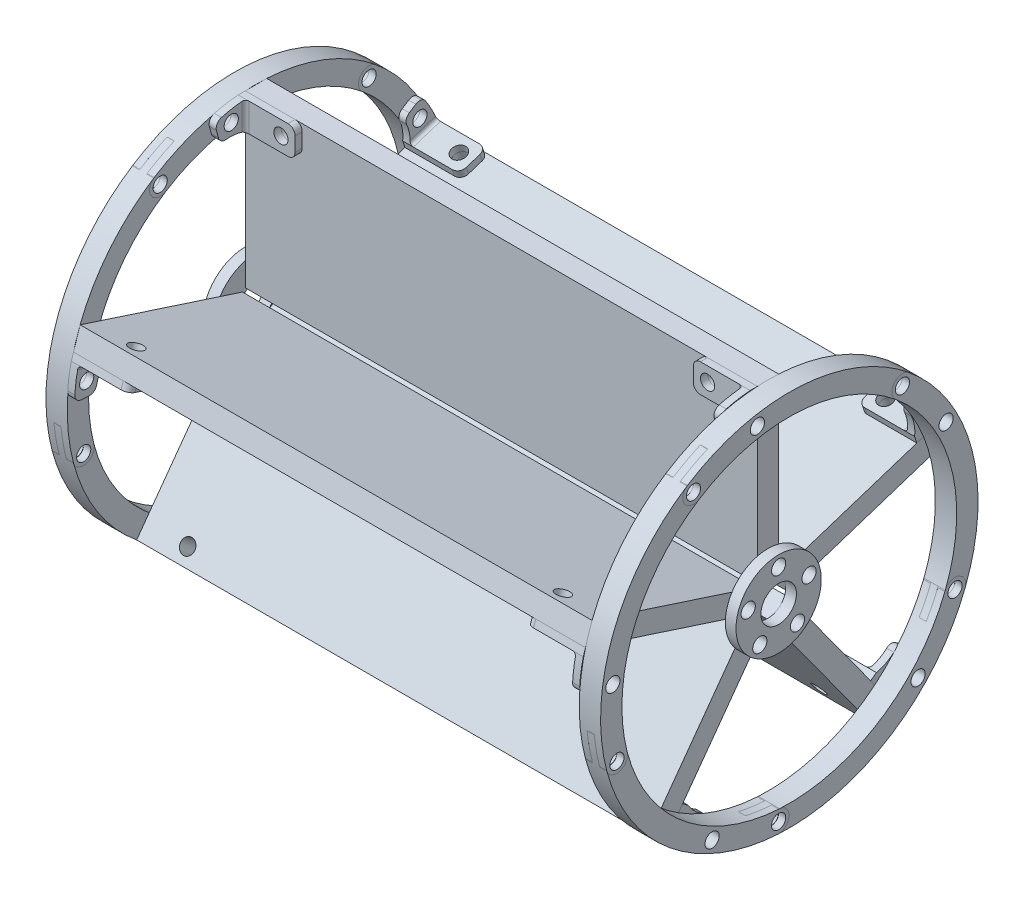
from build123d import *

# Parameters (mm, degrees)
SKETCH1_W                = 457.2
SKETCH1_H                = 152.4
SKETCH1_R                = 6.35
BOSS_EXTRUDE1_DEPTH      = 19.05
CIRPATTERN1_COUNT        = 5
SKETCH5_R                = 38.1
SKETCH5_R_2              = 15.875
BOSS_EXTRUDE2_DEPTH      = 9.525
SKETCH6_R                = 38.1
SKETCH6_R_2              = 15.875
BOSS_EXTRUDE3_DEPTH      = 9.525
CUT_EXTRUDE1_DEPTH       = 522.950438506
CUT_EXTRUDE1_DEPTH_BACK  = 522.950438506
SKETCH4_R                = 6.35
SKETCH8_R                = 6.35
BOSS_EXTRUDE4_DEPTH      = 19.05
BOSS_EXTRUDE6_DEPTH      = 3.175
BOSS_EXTRUDE6_DEPTH_BACK = 3.175
SKETCH10_R               = 6.35
CUT_EXTRUDE3_DEPTH       = 3.175
CUT_EXTRUDE3_DEPTH_BACK  = 3.175
CIRPATTERN3_COUNT        = 5
CIRPATTERN4_COUNT        = 5
SKETCH14_R               = 6.35
BOSS_EXTRUDE7_DEPTH      = 6.35
SKETCH15_R               = 6.35
BOSS_EXTRUDE8_DEPTH      = 6.35
FILLET1_R                = 6.35
FILLET3_R                = 3.175
SKETCH16_R               = 6.35
CUT_EXTRUDE5_DEPTH       = 541.863439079
CIRPATTERN6_COUNT        = 5
CIRPATTERN7_COUNT        = 5


with BuildPart() as part:
    # Sketch1 → Boss-Extrude1 (new body)
    with BuildSketch(Plane.XY):
        with Locations((228.6, 76.2)):
            Rectangle(SKETCH1_W, SKETCH1_H)
        with Locations(Location((38.1, 139.7, 0), (0, 0, 180))):
            Circle(SKETCH1_R, mode=Mode.SUBTRACT)
        with Locations(Location((419.1, 139.7, 0), (0, 0, 180))):
            Circle(SKETCH1_R, mode=Mode.SUBTRACT)
    extrude(amount=BOSS_EXTRUDE1_DEPTH)


with BuildPart() as cirpattern1_1:
    # CirPattern1: pattern copy
    add(part.part.rotate(Axis((0, -15.875, 9.525), (1, 0, 0)), 1 * 360 / CIRPATTERN1_COUNT))


with BuildPart() as cirpattern1_2:
    # CirPattern1: pattern copy
    add(part.part.rotate(Axis((0, -15.875, 9.525), (1, 0, 0)), 2 * 360 / CIRPATTERN1_COUNT))


with BuildPart() as cirpattern1_3:
    # CirPattern1: pattern copy
    add(part.part.rotate(Axis((0, -15.875, 9.525), (1, 0, 0)), 3 * 360 / CIRPATTERN1_COUNT))


with BuildPart() as cirpattern1_4:
    # CirPattern1: pattern copy
    add(part.part.rotate(Axis((0, -15.875, 9.525), (1, 0, 0)), 4 * 360 / CIRPATTERN1_COUNT))


with BuildPart() as body_6:
    # Sketch5 → Boss-Extrude2 (new body)
    with BuildSketch(Plane(origin=(457.2, 0, 0), x_dir=(0, 0, -1), z_dir=(1, 0, 0))):
        with Locations(Location((-9.525, -15.875, 0), (0, 0, 180))):
            Circle(SKETCH5_R)
        with Locations(Location((-9.525, -15.875, 0), (0, 0, 180))):
            Circle(SKETCH5_R_2, mode=Mode.SUBTRACT)
    extrude(amount=BOSS_EXTRUDE2_DEPTH)


with BuildPart() as body_7:
    # Sketch6 → Boss-Extrude3 (new body)
    with BuildSketch(Plane.ZY):
        with Locations(Location((9.525, -15.875, 0), (0, 0, 180))):
            Circle(SKETCH6_R)
        with Locations(Location((9.525, -15.875, 0), (0, 0, 180))):
            Circle(SKETCH6_R_2, mode=Mode.SUBTRACT)
    extrude(amount=BOSS_EXTRUDE3_DEPTH)


with BuildPart() as cut_extrude1_tool:
    # Sketch4 → Cut-Extrude1 (new, two sides: drawn at the far end of the back side and taken through both)
    with BuildSketch(Plane(origin=(457.2, 0, 0), x_dir=(0, 0, -1), z_dir=(1, 0, 0)).offset(-CUT_EXTRUDE1_DEPTH_BACK)):
        with Locations((-9.525, 12.7)):
            Circle(SKETCH4_R)
        with Locations((17.651439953, -7.044839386)):
            Circle(SKETCH4_R)
        with Locations((7.270963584, -38.992660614)):
            Circle(SKETCH4_R)
        with Locations((-26.320963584, -38.992660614)):
            Circle(SKETCH4_R)
        with Locations((-36.701439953, -7.044839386)):
            Circle(SKETCH4_R)
    extrude(amount=CUT_EXTRUDE1_DEPTH + CUT_EXTRUDE1_DEPTH_BACK)


with BuildPart() as part_1:
    add(part.part)

    # Cut-Extrude1: cut by cut_extrude1_tool
    add(cut_extrude1_tool.part, mode=Mode.SUBTRACT)


with BuildPart() as cirpattern1_1_1:
    add(cirpattern1_1.part)

    # Cut-Extrude1: cut by cut_extrude1_tool
    add(cut_extrude1_tool.part, mode=Mode.SUBTRACT)


with BuildPart() as cirpattern1_2_1:
    add(cirpattern1_2.part)

    # Cut-Extrude1: cut by cut_extrude1_tool
    add(cut_extrude1_tool.part, mode=Mode.SUBTRACT)


with BuildPart() as cirpattern1_3_1:
    add(cirpattern1_3.part)

    # Cut-Extrude1: cut by cut_extrude1_tool
    add(cut_extrude1_tool.part, mode=Mode.SUBTRACT)


with BuildPart() as cirpattern1_4_1:
    add(cirpattern1_4.part)

    # Cut-Extrude1: cut by cut_extrude1_tool
    add(cut_extrude1_tool.part, mode=Mode.SUBTRACT)


with BuildPart() as body_6_1:
    add(body_6.part)

    # Cut-Extrude1: cut by cut_extrude1_tool
    add(cut_extrude1_tool.part, mode=Mode.SUBTRACT)


with BuildPart() as body_7_1:
    add(body_7.part)

    # Cut-Extrude1: cut by cut_extrude1_tool
    add(cut_extrude1_tool.part, mode=Mode.SUBTRACT)


with BuildPart() as body_8:
    # Sketch8 → Boss-Extrude4 (new body)
    # profile 1 of 4: a face of its own
    with BuildSketch(Plane(origin=(457.2, 0, 0), x_dir=(0, 0, -1), z_dir=(1, 0, 0))):
        with BuildLine():
            Line((-19.05, 133.315609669), (-19.05, 152.4))
            ThreePointArc((-19.05, 152.4), (-61.608071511, 144.420211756), (-100.728676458, 125.860989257))
            ThreePointArc((-100.728676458, 125.860989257), (-102.825801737, 112.542536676), (-89.511153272, 110.421393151))
            ThreePointArc((-89.511153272, 110.421393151), (-55.721297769, 126.302585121), (-19.05, 133.315609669))
        make_face()
        with Locations(Location((-95.119914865, 118.141191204, 0), (0, 0, 180))):
            Circle(SKETCH8_R, mode=Mode.SUBTRACT)
    # profile 2 of 4: a face of its own
    with BuildSketch(Plane(origin=(457.2, 0, 0), x_dir=(0, 0, -1), z_dir=(1, 0, 0))):
        with BuildLine():
            Line((0, 133.315609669), (0, 152.4))
            Line((0, 152.4), (-19.05, 152.4))
            Line((-19.05, 152.4), (-19.05, 133.315609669))
            ThreePointArc((-19.05, 133.315609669), (-9.525, 133.619359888), (0, 133.315609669))
        make_face()
    # profile 3 of 4: a face of its own
    with BuildSketch(Plane(origin=(457.2, 0, 0), x_dir=(0, 0, -1), z_dir=(1, 0, 0))):
        with BuildLine():
            ThreePointArc((85.221128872, 99.761217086), (84.35778482, 112.80459482), (97.322712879, 114.473638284))
            ThreePointArc((97.322712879, 114.473638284), (51.673482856, 141.166226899), (0, 152.4))
            Line((0, 152.4), (0, 133.315609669))
            ThreePointArc((0, 133.315609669), (45.243525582, 123.22558319), (85.221128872, 99.761217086))
        make_face()
    # profile 4 of 4: a face of its own
    with BuildSketch(Plane(origin=(457.2, 0, 0), x_dir=(0, 0, -1), z_dir=(1, 0, 0))):
        with BuildLine():
            Line((-19.05, 152.4), (0, 152.4))
            ThreePointArc((0, 152.4), (-9.525, 152.669359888), (-19.05, 152.4))
        make_face()
    extrude(amount=BOSS_EXTRUDE4_DEPTH)

    # Sketch10 → Boss-Extrude6 (add, two sides: drawn at the far end of the back side and taken through both)
    with BuildSketch(Plane(origin=(466.725, 0, 0), x_dir=(0, 0, -1), z_dir=(1, 0, 0)).offset(-BOSS_EXTRUDE6_DEPTH_BACK)):
        with BuildLine():
            Line((102.853447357, 82.71327622), (117.173783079, 95.276336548))
            ThreePointArc((117.173783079, 95.276336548), (107.642083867, 105.282235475), (97.322712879, 114.473638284))
            ThreePointArc((97.322712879, 114.473638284), (84.35778482, 112.80459482), (85.221128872, 99.761217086))
            ThreePointArc((85.221128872, 99.761217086), (94.38749003, 91.599452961), (102.853447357, 82.71327622))
        make_face()
        with Locations((91.728128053, 106.742178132)):
            Circle(SKETCH10_R, mode=Mode.SUBTRACT)
    extrude(amount=BOSS_EXTRUDE6_DEPTH + BOSS_EXTRUDE6_DEPTH_BACK)

    # Sketch11 → Cut-Extrude3 (cut, two sides: drawn at the far end of the back side and taken through both)
    with BuildSketch(Plane(origin=(466.725, 0, 0), x_dir=(0, 0, -1), z_dir=(1, 0, 0)).offset(-CUT_EXTRUDE3_DEPTH_BACK)):
        with BuildLine():
            Line((-76.377372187, 138.843976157), (-68.821274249, 121.356612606))
            ThreePointArc((-68.821274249, 121.356612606), (-79.871083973, 116.034029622), (-90.447394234, 109.823567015))
            ThreePointArc((-90.447394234, 109.823567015), (-103.139178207, 113.001386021), (-100.728676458, 125.860989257))
            ThreePointArc((-100.728676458, 125.860989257), (-88.819187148, 132.851706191), (-76.377372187, 138.843976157))
        make_face()
    extrude(amount=CUT_EXTRUDE3_DEPTH + CUT_EXTRUDE3_DEPTH_BACK, mode=Mode.SUBTRACT)


with BuildPart() as cirpattern3_1:
    # CirPattern3: pattern copy
    add(body_8.part.rotate(Axis((0, -15.875, 9.525), (1, 0, 0)), 1 * 360 / CIRPATTERN3_COUNT))


with BuildPart() as cirpattern3_2:
    # CirPattern3: pattern copy
    add(body_8.part.rotate(Axis((0, -15.875, 9.525), (1, 0, 0)), 2 * 360 / CIRPATTERN3_COUNT))


with BuildPart() as cirpattern3_3:
    # CirPattern3: pattern copy
    add(body_8.part.rotate(Axis((0, -15.875, 9.525), (1, 0, 0)), 3 * 360 / CIRPATTERN3_COUNT))


with BuildPart() as cirpattern3_4:
    # CirPattern3: pattern copy
    add(body_8.part.rotate(Axis((0, -15.875, 9.525), (1, 0, 0)), 4 * 360 / CIRPATTERN3_COUNT))


with BuildPart() as body_13:
    # Mirror2: mirrored copy
    add(body_8.part.mirror(Plane(origin=(228.6, 0, 0), x_dir=(0, 0, 1), z_dir=(1, 0, 0))))


with BuildPart() as cirpattern4_1:
    # CirPattern4: pattern copy
    add(body_13.part.rotate(Axis((0, -15.875, 9.525), (1, 0, 0)), 1 * 360 / CIRPATTERN4_COUNT))


with BuildPart() as cirpattern4_2:
    # CirPattern4: pattern copy
    add(body_13.part.rotate(Axis((0, -15.875, 9.525), (1, 0, 0)), 2 * 360 / CIRPATTERN4_COUNT))


with BuildPart() as cirpattern4_3:
    # CirPattern4: pattern copy
    add(body_13.part.rotate(Axis((0, -15.875, 9.525), (1, 0, 0)), 3 * 360 / CIRPATTERN4_COUNT))


with BuildPart() as cirpattern4_4:
    # CirPattern4: pattern copy
    add(body_13.part.rotate(Axis((0, -15.875, 9.525), (1, 0, 0)), 4 * 360 / CIRPATTERN4_COUNT))


with BuildPart() as body_18:
    # Sketch14 → Boss-Extrude7 (new body)
    with BuildSketch(Plane.XY.offset(19.05)):
        with BuildLine():
            Line((0, 152.4), (44.45, 152.4))
            ThreePointArc((44.45, 152.4), (48.940128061, 150.540128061), (50.8, 146.05))
            Line((50.8, 146.05), (50.8, 133.35))
            ThreePointArc((50.8, 133.35), (48.940128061, 128.859871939), (44.45, 127))
            Line((44.45, 127), (0, 127))
            Line((0, 127), (0, 152.4))
        make_face()
        with Locations((38.1, 139.7)):
            Circle(SKETCH14_R, mode=Mode.SUBTRACT)
    extrude(amount=BOSS_EXTRUDE7_DEPTH)

    # Sketch15 → Boss-Extrude8 (add)
    # profile 1 of 3: a face of its own
    with BuildSketch(Plane(origin=(0, 0, 0), x_dir=(0, 0, -1), z_dir=(1, 0, 0))):
        with BuildLine():
            Line((-25.4, 132.774076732), (-25.4, 151.920070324))
            ThreePointArc((-25.4, 151.920070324), (-39.210109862, 150.034600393), (-52.817206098, 147.014490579))
            Line((-52.817206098, 147.014490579), (-47.924034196, 128.603641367))
            ThreePointArc((-47.924034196, 128.603641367), (-47.059728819, 128.840491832), (-46.189262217, 129.053587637))
            ThreePointArc((-46.189262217, 129.053587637), (-35.860413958, 131.281412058), (-25.4, 132.774076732))
        make_face()
        with Locations((-37.9762469, 140.578454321)):
            Circle(SKETCH15_R, mode=Mode.SUBTRACT)
    # profile 2 of 3: a face of its own
    with BuildSketch(Plane(origin=(0, 0, 0), x_dir=(0, 0, -1), z_dir=(1, 0, 0))):
        with BuildLine():
            Line((-25.4, 127), (-25.4, 132.774076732))
            ThreePointArc((-25.4, 132.774076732), (-35.860413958, 131.281412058), (-46.189262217, 129.053587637))
            ThreePointArc((-46.189262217, 129.053587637), (-35.626369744, 129.730168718), (-25.4, 127))
        make_face()
    # profile 3 of 3: a face of its own
    with BuildSketch(Plane(origin=(0, 0, 0), x_dir=(0, 0, -1), z_dir=(1, 0, 0))):
        with BuildLine():
            ThreePointArc((-52.817206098, 147.014490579), (-39.210109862, 150.034600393), (-25.4, 151.920070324))
            Line((-25.4, 151.920070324), (-25.4, 152.4))
            ThreePointArc((-25.4, 152.4), (-39.268937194, 150.523493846), (-52.817206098, 147.014490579))
        make_face()
    extrude(amount=BOSS_EXTRUDE8_DEPTH)

    # Fillet1
    fillet1_edges = [body_18.edges().sort_by_distance(p)[0] for p in [
        (3.175, 128.603641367, 47.924034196),
        (3.175, 147.014490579, 52.817206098),
    ]]
    fillet(fillet1_edges, radius=FILLET1_R)

    # Fillet3
    fillet3_edges = [body_18.edges().sort_by_distance(p)[0] for p in [
        (6.35, 139.7, 25.4),
    ]]
    fillet(fillet3_edges, radius=FILLET3_R)


with BuildPart() as cut_extrude5_tool:
    # Sketch16 → Cut-Extrude5 (new, symmetric)
    with BuildSketch(Plane(origin=(0, 0, 0), x_dir=(0, 0, -1), z_dir=(1, 0, 0))):
        with Locations((-37.9762469, 140.578454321)):
            Circle(SKETCH16_R)
    cut_extrude5 = extrude(amount=CUT_EXTRUDE5_DEPTH, both=True)


with BuildPart() as body_8_1:
    add(body_8.part)

    # Cut-Extrude5: cut by cut_extrude5_tool
    add(cut_extrude5_tool.part, mode=Mode.SUBTRACT)


with BuildPart() as body_13_1:
    add(body_13.part)

    # Cut-Extrude5: cut by cut_extrude5_tool
    add(cut_extrude5_tool.part, mode=Mode.SUBTRACT)


with BuildPart() as cirpattern6_tool:
    # CirPattern6: Cut-Extrude5 ×5 about axis
    cirpattern6_axis = Axis((0, -15.875, 9.525), (1, 0, 0))
    for i in range(1, CIRPATTERN6_COUNT):
        add(cut_extrude5.rotate(cirpattern6_axis, i * 360 / CIRPATTERN6_COUNT))


with BuildPart() as cirpattern3_1_1:
    add(cirpattern3_1.part)

    # CirPattern6: cut by cirpattern6_tool
    add(cirpattern6_tool.part, mode=Mode.SUBTRACT)


with BuildPart() as cirpattern3_2_1:
    add(cirpattern3_2.part)

    # CirPattern6: cut by cirpattern6_tool
    add(cirpattern6_tool.part, mode=Mode.SUBTRACT)


with BuildPart() as cirpattern3_3_1:
    add(cirpattern3_3.part)

    # CirPattern6: cut by cirpattern6_tool
    add(cirpattern6_tool.part, mode=Mode.SUBTRACT)


with BuildPart() as cirpattern3_4_1:
    add(cirpattern3_4.part)

    # CirPattern6: cut by cirpattern6_tool
    add(cirpattern6_tool.part, mode=Mode.SUBTRACT)


with BuildPart() as cirpattern4_1_1:
    add(cirpattern4_1.part)

    # CirPattern6: cut by cirpattern6_tool
    add(cirpattern6_tool.part, mode=Mode.SUBTRACT)


with BuildPart() as cirpattern4_2_1:
    add(cirpattern4_2.part)

    # CirPattern6: cut by cirpattern6_tool
    add(cirpattern6_tool.part, mode=Mode.SUBTRACT)


with BuildPart() as cirpattern4_3_1:
    add(cirpattern4_3.part)

    # CirPattern6: cut by cirpattern6_tool
    add(cirpattern6_tool.part, mode=Mode.SUBTRACT)


with BuildPart() as cirpattern4_4_1:
    add(cirpattern4_4.part)

    # CirPattern6: cut by cirpattern6_tool
    add(cirpattern6_tool.part, mode=Mode.SUBTRACT)


with BuildPart() as body_19:
    # Mirror3: mirrored copy
    add(body_18.part.mirror(Plane(origin=(228.6, 0, 0), x_dir=(0, 0, 1), z_dir=(1, 0, 0))))


with BuildPart() as cirpattern7_1:
    # CirPattern7: pattern copy
    add(body_19.part.rotate(Axis((0, -15.875, 9.525), (1, 0, 0)), 1 * 360 / CIRPATTERN7_COUNT))


with BuildPart() as cirpattern7_2:
    # CirPattern7: pattern copy
    add(body_19.part.rotate(Axis((0, -15.875, 9.525), (1, 0, 0)), 2 * 360 / CIRPATTERN7_COUNT))


with BuildPart() as cirpattern7_3:
    # CirPattern7: pattern copy
    add(body_19.part.rotate(Axis((0, -15.875, 9.525), (1, 0, 0)), 3 * 360 / CIRPATTERN7_COUNT))


with BuildPart() as cirpattern7_4:
    # CirPattern7: pattern copy
    add(body_19.part.rotate(Axis((0, -15.875, 9.525), (1, 0, 0)), 4 * 360 / CIRPATTERN7_COUNT))


with BuildPart() as cirpattern7_5:
    # CirPattern7: pattern copy
    add(body_18.part.rotate(Axis((0, -15.875, 9.525), (1, 0, 0)), 1 * 360 / CIRPATTERN7_COUNT))


with BuildPart() as cirpattern7_6:
    # CirPattern7: pattern copy
    add(body_18.part.rotate(Axis((0, -15.875, 9.525), (1, 0, 0)), 2 * 360 / CIRPATTERN7_COUNT))


with BuildPart() as cirpattern7_7:
    # CirPattern7: pattern copy
    add(body_18.part.rotate(Axis((0, -15.875, 9.525), (1, 0, 0)), 3 * 360 / CIRPATTERN7_COUNT))


with BuildPart() as cirpattern7_8:
    # CirPattern7: pattern copy
    add(body_18.part.rotate(Axis((0, -15.875, 9.525), (1, 0, 0)), 4 * 360 / CIRPATTERN7_COUNT))


solid = Compound([part_1.part, cirpattern1_1_1.part, cirpattern1_2_1.part, cirpattern1_3_1.part, cirpattern1_4_1.part, body_6_1.part, body_7_1.part, body_18.part, body_8_1.part, body_13_1.part, cirpattern3_1_1.part, cirpattern3_2_1.part, cirpattern3_3_1.part, cirpattern3_4_1.part, cirpattern4_1_1.part, cirpattern4_2_1.part, cirpattern4_3_1.part, cirpattern4_4_1.part, body_19.part, cirpattern7_1.part, cirpattern7_2.part, cirpattern7_3.part, cirpattern7_4.part, cirpattern7_5.part, cirpattern7_6.part, cirpattern7_7.part, cirpattern7_8.part])
